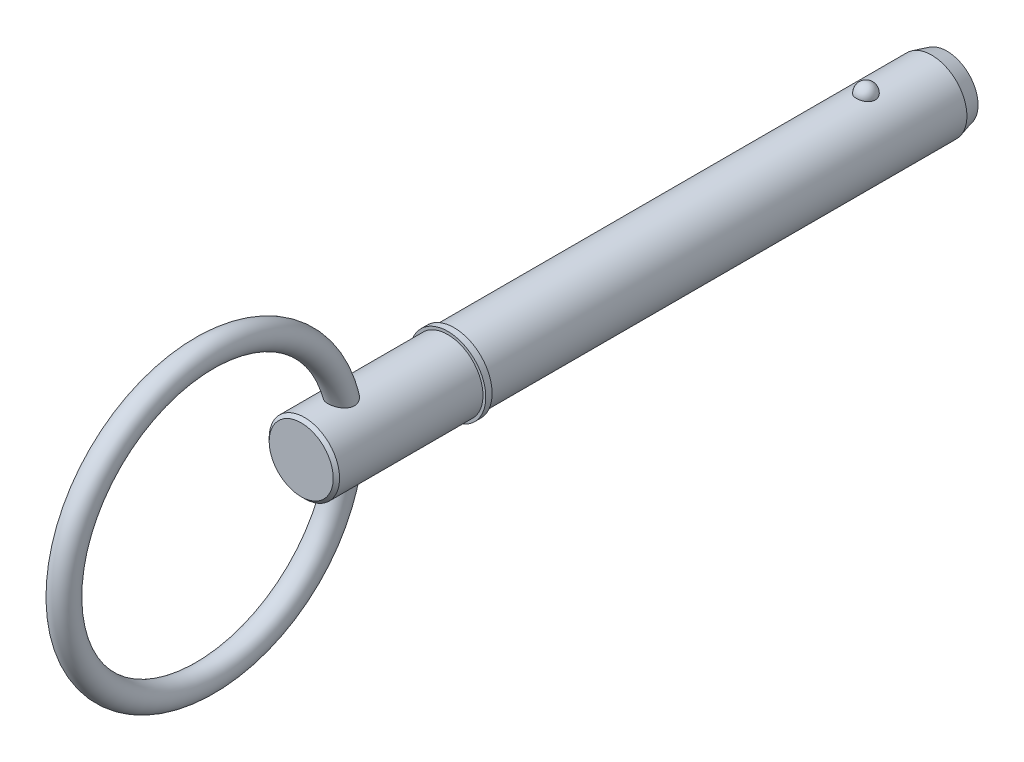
ISO-10303-21;
HEADER;
FILE_DESCRIPTION(('STEP AP214'),'2;1');
FILE_NAME('part.step','',(''),(''),'','','');
FILE_SCHEMA(('AUTOMOTIVE_DESIGN { 1 0 10303 214 1 1 1 1 }'));
ENDSEC;
DATA;
#1=APPLICATION_CONTEXT('core data for automotive mechanical design processes');
#2=APPLICATION_PROTOCOL_DEFINITION('international standard','automotive_design',2000,#1);
#3=PRODUCT_CONTEXT('',#1,'mechanical');
#4=PRODUCT('Part','Part','',(#3));
#5=PRODUCT_RELATED_PRODUCT_CATEGORY('part','',(#4));
#6=PRODUCT_DEFINITION_FORMATION('','',#4);
#7=PRODUCT_DEFINITION_CONTEXT('part definition',#1,'design');
#8=PRODUCT_DEFINITION('design','',#6,#7);
#9=PRODUCT_DEFINITION_SHAPE('','',#8);
#10=(LENGTH_UNIT() NAMED_UNIT(*) SI_UNIT(.MILLI.,.METRE.));
#11=(NAMED_UNIT(*) PLANE_ANGLE_UNIT() SI_UNIT($,.RADIAN.));
#12=(NAMED_UNIT(*) SI_UNIT($,.STERADIAN.) SOLID_ANGLE_UNIT());
#13=UNCERTAINTY_MEASURE_WITH_UNIT(LENGTH_MEASURE(1.E-05),#10,'distance_accuracy_value','');
#14=(GEOMETRIC_REPRESENTATION_CONTEXT(3) GLOBAL_UNCERTAINTY_ASSIGNED_CONTEXT((#13)) GLOBAL_UNIT_ASSIGNED_CONTEXT((#10,
#11,#12)) REPRESENTATION_CONTEXT('',''));
#15=CARTESIAN_POINT('',(0.,0.,0.));
#16=DIRECTION('',(0.,0.,1.));
#17=DIRECTION('',(1.,0.,0.));
#18=AXIS2_PLACEMENT_3D('',#15,#16,#17);
#19=CARTESIAN_POINT('',(0.,0.,63.5));
#20=DIRECTION('',(0.,0.,-1.));
#21=DIRECTION('',(-1.,0.,0.));
#22=AXIS2_PLACEMENT_3D('',#19,#20,#21);
#23=CYLINDRICAL_SURFACE('',#22,5.555);
#24=CARTESIAN_POINT('',(1.47653932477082,5.35517101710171,-1.49));
#25=CARTESIAN_POINT('',(1.4765376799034,5.35517235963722,-1.40667872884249));
#26=CARTESIAN_POINT('',(1.4697233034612,5.35706459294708,-1.32333626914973));
#27=CARTESIAN_POINT('',(1.4426291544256,5.36442332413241,-1.15900769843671));
#28=CARTESIAN_POINT('',(1.42234344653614,5.36989139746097,-1.07802264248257));
#29=CARTESIAN_POINT('',(1.36882802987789,5.38378061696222,-0.920757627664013));
#30=CARTESIAN_POINT('',(1.33560404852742,5.39220045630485,-0.844475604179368));
#31=CARTESIAN_POINT('',(1.25704906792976,5.41105136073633,-0.69870312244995));
#32=CARTESIAN_POINT('',(1.21171855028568,5.42148234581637,-0.62921239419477));
#33=CARTESIAN_POINT('',(1.10986325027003,5.44324765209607,-0.498626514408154));
#34=CARTESIAN_POINT('',(1.05328868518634,5.45458585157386,-0.43757082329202));
#35=CARTESIAN_POINT('',(0.930545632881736,5.4768596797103,-0.325918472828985));
#36=CARTESIAN_POINT('',(0.864377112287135,5.48779530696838,-0.275321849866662));
#37=CARTESIAN_POINT('',(0.724412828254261,5.50801510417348,-0.186125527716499));
#38=CARTESIAN_POINT('',(0.650637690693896,5.51730356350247,-0.147494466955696));
#39=CARTESIAN_POINT('',(0.497383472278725,5.53322345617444,-0.0831582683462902));
#40=CARTESIAN_POINT('',(0.417904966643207,5.53985515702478,-0.0574518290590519));
#41=CARTESIAN_POINT('',(0.256903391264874,5.54963245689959,-0.0200294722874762));
#42=CARTESIAN_POINT('',(0.17543580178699,5.55283384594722,-0.00808940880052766));
#43=CARTESIAN_POINT('',(0.011588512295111,5.55559187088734,0.00221439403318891));
#44=CARTESIAN_POINT('',(-0.0707911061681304,5.55514883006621,0.000579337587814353));
#45=CARTESIAN_POINT('',(-0.232980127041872,5.55069756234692,-0.0161051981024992));
#46=CARTESIAN_POINT('',(-0.312809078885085,5.54673626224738,-0.0309781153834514));
#47=CARTESIAN_POINT('',(-0.468771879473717,5.5357377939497,-0.0734743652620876));
#48=CARTESIAN_POINT('',(-0.544905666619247,5.52870057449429,-0.101097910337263));
#49=CARTESIAN_POINT('',(-0.691800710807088,5.51225307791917,-0.168516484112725));
#50=CARTESIAN_POINT('',(-0.762530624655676,5.50283015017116,-0.208376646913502));
#51=CARTESIAN_POINT('',(-0.896294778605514,5.48263289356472,-0.299136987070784));
#52=CARTESIAN_POINT('',(-0.959328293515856,5.47185843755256,-0.350038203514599));
#53=CARTESIAN_POINT('',(-1.07712789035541,5.44990641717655,-0.462517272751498));
#54=CARTESIAN_POINT('',(-1.13172901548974,5.43872509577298,-0.524267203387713));
#55=CARTESIAN_POINT('',(-1.2299173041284,5.41736658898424,-0.6561336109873));
#56=CARTESIAN_POINT('',(-1.2735037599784,5.40718946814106,-0.726250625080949));
#57=CARTESIAN_POINT('',(-1.34896420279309,5.38886361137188,-0.873713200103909));
#58=CARTESIAN_POINT('',(-1.38071142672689,5.38073711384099,-0.951126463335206));
#59=CARTESIAN_POINT('',(-1.4310375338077,5.36757288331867,-1.11037033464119));
#60=CARTESIAN_POINT('',(-1.44961676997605,5.3625350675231,-1.19220082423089));
#61=CARTESIAN_POINT('',(-1.47308754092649,5.35613553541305,-1.35761209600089));
#62=CARTESIAN_POINT('',(-1.47803294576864,5.35475935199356,-1.44118467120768));
#63=CARTESIAN_POINT('',(-1.47426441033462,5.35579807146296,-1.6079958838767));
#64=CARTESIAN_POINT('',(-1.46555080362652,5.35821288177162,-1.69123452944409));
#65=CARTESIAN_POINT('',(-1.43475662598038,5.36653964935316,-1.8546288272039));
#66=CARTESIAN_POINT('',(-1.41273621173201,5.37243586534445,-1.93479663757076));
#67=CARTESIAN_POINT('',(-1.35593151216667,5.38705199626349,-2.0902011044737));
#68=CARTESIAN_POINT('',(-1.32114675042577,5.39577201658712,-2.16543757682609));
#69=CARTESIAN_POINT('',(-1.23947506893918,5.41511674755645,-2.30926926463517));
#70=CARTESIAN_POINT('',(-1.1925277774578,5.42575087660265,-2.37782893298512));
#71=CARTESIAN_POINT('',(-1.08780725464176,5.44771095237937,-2.50598876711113));
#72=CARTESIAN_POINT('',(-1.03003365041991,5.4590369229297,-2.56558862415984));
#73=CARTESIAN_POINT('',(-0.90495349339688,5.48116073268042,-2.67436535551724));
#74=CARTESIAN_POINT('',(-0.837616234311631,5.49195671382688,-2.7235073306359));
#75=CARTESIAN_POINT('',(-0.69537970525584,5.51177099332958,-2.8097317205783));
#76=CARTESIAN_POINT('',(-0.620480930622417,5.52078940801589,-2.84681492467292));
#77=CARTESIAN_POINT('',(-0.466144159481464,5.53594369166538,-2.90749751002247));
#78=CARTESIAN_POINT('',(-0.386768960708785,5.54211181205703,-2.93124844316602));
#79=CARTESIAN_POINT('',(-0.224991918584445,5.5510324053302,-2.96523308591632));
#80=CARTESIAN_POINT('',(-0.142590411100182,5.55378525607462,-2.97546829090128));
#81=CARTESIAN_POINT('',(0.0213711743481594,5.55555351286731,-2.98206550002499));
#82=CARTESIAN_POINT('',(0.102921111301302,5.55463281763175,-2.97866468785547));
#83=CARTESIAN_POINT('',(0.2642564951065,5.54929804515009,-2.95862186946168));
#84=CARTESIAN_POINT('',(0.344041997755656,5.54488407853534,-2.94198028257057));
#85=CARTESIAN_POINT('',(0.499344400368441,5.53305794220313,-2.89600357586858));
#86=CARTESIAN_POINT('',(0.574874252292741,5.52565550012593,-2.86670961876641));
#87=CARTESIAN_POINT('',(0.71989857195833,5.50863937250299,-2.79624249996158));
#88=CARTESIAN_POINT('',(0.78939269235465,5.49902555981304,-2.75506865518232));
#89=CARTESIAN_POINT('',(0.921480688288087,5.47845199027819,-2.66127110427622));
#90=CARTESIAN_POINT('',(0.983960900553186,5.46747485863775,-2.60849118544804));
#91=CARTESIAN_POINT('',(1.09925057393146,5.44546837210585,-2.49325304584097));
#92=CARTESIAN_POINT('',(1.15205830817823,5.43443900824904,-2.43079310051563));
#93=CARTESIAN_POINT('',(1.24742943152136,5.41335152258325,-2.29680711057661));
#94=CARTESIAN_POINT('',(1.28981661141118,5.40331162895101,-2.22515272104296));
#95=CARTESIAN_POINT('',(1.36214937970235,5.38553336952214,-2.07558035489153));
#96=CARTESIAN_POINT('',(1.39210034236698,5.37779400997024,-1.99766510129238));
#97=CARTESIAN_POINT('',(1.43569518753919,5.36630594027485,-1.84848338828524));
#98=CARTESIAN_POINT('',(1.45098536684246,5.36216169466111,-1.77772322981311));
#99=CARTESIAN_POINT('',(1.47140805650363,5.35659367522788,-1.63464735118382));
#100=CARTESIAN_POINT('',(1.47654075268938,5.35516985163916,-1.56233165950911));
#101=CARTESIAN_POINT('',(1.47653932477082,5.35517101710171,-1.49));
#102=B_SPLINE_CURVE_WITH_KNOTS('',3,(#24,#25,#26,#27,#28,#29,#30,#31,#32,#33,#34,#35,#36,#37,
#38,#39,#40,#41,#42,#43,#44,#45,#46,#47,#48,#49,#50,#51,#52,#53,#54,#55,#56,#57,#58,#59,#60,#61,
#62,#63,#64,#65,#66,#67,#68,#69,#70,#71,#72,#73,#74,#75,#76,#77,#78,#79,#80,#81,#82,#83,#84,#85,
#86,#87,#88,#89,#90,#91,#92,#93,#94,#95,#96,#97,#98,#99,#100,#101),.UNSPECIFIED.,.T.,.F.,(4,2,2,
2,2,2,2,2,2,2,2,2,2,2,2,2,2,2,2,2,2,2,2,2,2,2,2,2,2,2,2,2,2,2,2,2,2,2,4),(0.,0.249703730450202,
0.4995175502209,0.749220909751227,0.998914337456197,1.24973894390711,1.50056442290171,
1.75072681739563,2.00086401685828,2.24686822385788,2.49285060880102,2.73560052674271,
2.97835449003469,3.22242369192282,3.46651587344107,3.71490232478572,3.96330473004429,
4.21429522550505,4.46527899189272,4.71526963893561,4.96525418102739,5.21411697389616,
5.46298905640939,5.71312097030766,5.96326150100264,6.21422412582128,6.46517032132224,
6.71320296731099,6.96120816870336,7.20491846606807,7.44862104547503,7.69153667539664,
7.93446627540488,8.18089104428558,8.42735976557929,8.67774679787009,8.92802551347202,
9.14479867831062,9.36156787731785),.UNSPECIFIED.);
#103=CARTESIAN_POINT('',(1.47653932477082,5.35517101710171,-1.49));
#104=VERTEX_POINT('',#103);
#105=EDGE_CURVE('E103',#104,#104,#102,.T.);
#106=ORIENTED_EDGE('',*,*,#105,.T.);
#107=EDGE_LOOP('',(#106));
#108=FACE_BOUND('',#107,.T.);
#109=CARTESIAN_POINT('',(0.,0.,-11.87));
#110=DIRECTION('',(0.,0.,-1.));
#111=DIRECTION('',(-1.,0.,0.));
#112=AXIS2_PLACEMENT_3D('',#109,#110,#111);
#113=CIRCLE('',#112,5.555);
#114=CARTESIAN_POINT('',(-5.555,0.,-11.87));
#115=VERTEX_POINT('',#114);
#116=EDGE_CURVE('E111',#115,#115,#113,.F.);
#117=ORIENTED_EDGE('',*,*,#116,.T.);
#118=EDGE_LOOP('',(#117));
#119=FACE_BOUND('',#118,.T.);
#120=CARTESIAN_POINT('',(0.,0.,63.5));
#121=DIRECTION('',(0.,0.,1.));
#122=DIRECTION('',(1.,0.,0.));
#123=AXIS2_PLACEMENT_3D('',#120,#121,#122);
#124=CIRCLE('',#123,5.555);
#125=CARTESIAN_POINT('',(5.555,0.,63.5));
#126=VERTEX_POINT('',#125);
#127=EDGE_CURVE('E109',#126,#126,#124,.T.);
#128=ORIENTED_EDGE('',*,*,#127,.F.);
#129=EDGE_LOOP('',(#128));
#130=FACE_BOUND('',#129,.T.);
#131=ADVANCED_FACE('F39',(#108,#119,#130),#23,.T.);
#132=CARTESIAN_POINT('',(0.,0.,-14.27));
#133=DIRECTION('',(0.,0.,-1.));
#134=DIRECTION('',(-1.,0.,0.));
#135=AXIS2_PLACEMENT_3D('',#132,#133,#134);
#136=PLANE('',#135);
#137=CARTESIAN_POINT('',(0.,0.,-14.27));
#138=DIRECTION('',(0.,0.,-1.));
#139=DIRECTION('',(-1.,0.,0.));
#140=AXIS2_PLACEMENT_3D('',#137,#138,#139);
#141=CIRCLE('',#140,4.91192193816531);
#142=CARTESIAN_POINT('',(-4.91192193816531,0.,-14.27));
#143=VERTEX_POINT('',#142);
#144=EDGE_CURVE('E144',#143,#143,#141,.T.);
#145=ORIENTED_EDGE('',*,*,#144,.T.);
#146=EDGE_LOOP('',(#145));
#147=FACE_BOUND('',#146,.T.);
#148=ADVANCED_FACE('F89',(#147),#136,.T.);
#149=CARTESIAN_POINT('',(0.,0.,-14.27));
#150=DIRECTION('',(0.,0.,1.));
#151=DIRECTION('',(1.,0.,0.));
#152=AXIS2_PLACEMENT_3D('',#149,#150,#151);
#153=CONICAL_SURFACE('',#152,4.91192193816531,0.261799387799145);
#154=ORIENTED_EDGE('',*,*,#116,.F.);
#155=EDGE_LOOP('',(#154));
#156=FACE_BOUND('',#155,.T.);
#157=ORIENTED_EDGE('',*,*,#144,.F.);
#158=EDGE_LOOP('',(#157));
#159=FACE_BOUND('',#158,.T.);
#160=ADVANCED_FACE('F95',(#156,#159),#153,.T.);
#161=CARTESIAN_POINT('',(0.,5.555,-1.49));
#162=DIRECTION('',(0.,1.,0.));
#163=DIRECTION('',(0.,0.,1.));
#164=AXIS2_PLACEMENT_3D('',#161,#162,#163);
#165=SPHERICAL_SURFACE('',#164,1.49);
#166=ORIENTED_EDGE('',*,*,#105,.F.);
#167=EDGE_LOOP('',(#166));
#168=FACE_BOUND('',#167,.T.);
#169=ADVANCED_FACE('F114',(#168),#165,.T.);
#170=CARTESIAN_POINT('',(0.,0.,63.5));
#171=DIRECTION('',(0.,0.,-1.));
#172=DIRECTION('',(-1.,0.,0.));
#173=AXIS2_PLACEMENT_3D('',#170,#171,#172);
#174=PLANE('',#173);
#175=ORIENTED_EDGE('',*,*,#127,.T.);
#176=EDGE_LOOP('',(#175));
#177=FACE_BOUND('',#176,.T.);
#178=CARTESIAN_POINT('',(0.,0.,63.5));
#179=DIRECTION('',(0.,0.,-1.));
#180=DIRECTION('',(-1.,0.,0.));
#181=AXIS2_PLACEMENT_3D('',#178,#179,#180);
#182=CIRCLE('',#181,6.);
#183=CARTESIAN_POINT('',(-6.,0.,63.5));
#184=VERTEX_POINT('',#183);
#185=EDGE_CURVE('E110',#184,#184,#182,.T.);
#186=ORIENTED_EDGE('',*,*,#185,.T.);
#187=EDGE_LOOP('',(#186));
#188=FACE_BOUND('',#187,.T.);
#189=ADVANCED_FACE('F118',(#177,#188),#174,.T.);
#190=CARTESIAN_POINT('',(0.,0.,33.7287874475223));
#191=DIRECTION('',(0.,0.,-1.));
#192=DIRECTION('',(-1.,0.,0.));
#193=AXIS2_PLACEMENT_3D('',#190,#191,#192);
#194=CYLINDRICAL_SURFACE('',#193,6.);
#195=CARTESIAN_POINT('',(0.,0.,64.5));
#196=DIRECTION('',(0.,0.,-1.));
#197=DIRECTION('',(-1.,0.,0.));
#198=AXIS2_PLACEMENT_3D('',#195,#196,#197);
#199=CIRCLE('',#198,6.);
#200=CARTESIAN_POINT('',(-6.,0.,64.5));
#201=VERTEX_POINT('',#200);
#202=EDGE_CURVE('E135',#201,#201,#199,.T.);
#203=ORIENTED_EDGE('',*,*,#202,.T.);
#204=EDGE_LOOP('',(#203));
#205=FACE_BOUND('',#204,.T.);
#206=ORIENTED_EDGE('',*,*,#185,.F.);
#207=EDGE_LOOP('',(#206));
#208=FACE_BOUND('',#207,.T.);
#209=ADVANCED_FACE('F122',(#205,#208),#194,.T.);
#210=CARTESIAN_POINT('',(0.,6.,64.5));
#211=DIRECTION('',(0.,0.,1.));
#212=DIRECTION('',(1.,0.,0.));
#213=AXIS2_PLACEMENT_3D('',#210,#211,#212);
#214=PLANE('',#213);
#215=CARTESIAN_POINT('',(0.,0.,64.5));
#216=DIRECTION('',(0.,0.,1.));
#217=DIRECTION('',(1.,0.,0.));
#218=AXIS2_PLACEMENT_3D('',#215,#216,#217);
#219=CIRCLE('',#218,5.555);
#220=CARTESIAN_POINT('',(5.555,0.,64.5));
#221=VERTEX_POINT('',#220);
#222=EDGE_CURVE('E113',#221,#221,#219,.T.);
#223=ORIENTED_EDGE('',*,*,#222,.F.);
#224=EDGE_LOOP('',(#223));
#225=FACE_BOUND('',#224,.T.);
#226=ORIENTED_EDGE('',*,*,#202,.F.);
#227=EDGE_LOOP('',(#226));
#228=FACE_BOUND('',#227,.T.);
#229=ADVANCED_FACE('F86',(#225,#228),#214,.T.);
#230=CARTESIAN_POINT('',(0.,0.,87.63));
#231=DIRECTION('',(0.,0.,-1.));
#232=DIRECTION('',(-1.,0.,0.));
#233=AXIS2_PLACEMENT_3D('',#230,#231,#232);
#234=CYLINDRICAL_SURFACE('',#233,5.555);
#235=CARTESIAN_POINT('',(-0.961380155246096,-5.47117658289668,79.5087332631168));
#236=CARTESIAN_POINT('',(-0.863231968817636,-5.48842171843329,79.4575155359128));
#237=CARTESIAN_POINT('',(-0.7605484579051,-5.50372118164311,79.4143181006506));
#238=CARTESIAN_POINT('',(-0.548956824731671,-5.52883500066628,79.3449127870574));
#239=CARTESIAN_POINT('',(-0.440048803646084,-5.53864944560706,79.3187046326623));
#240=CARTESIAN_POINT('',(-0.219033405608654,-5.55178384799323,79.2838646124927));
#241=CARTESIAN_POINT('',(-0.106925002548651,-5.55510169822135,79.2752384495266));
#242=CARTESIAN_POINT('',(0.11723899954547,-5.55489351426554,79.2757834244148));
#243=CARTESIAN_POINT('',(0.229294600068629,-5.55136768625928,79.2849540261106));
#244=CARTESIAN_POINT('',(0.449588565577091,-5.5378711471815,79.3207847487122));
#245=CARTESIAN_POINT('',(0.557843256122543,-5.52793284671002,79.3473569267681));
#246=CARTESIAN_POINT('',(0.768116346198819,-5.50265785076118,79.4173095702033));
#247=CARTESIAN_POINT('',(0.87013418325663,-5.48732066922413,79.4606915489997));
#248=CARTESIAN_POINT('',(1.06580880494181,-5.45270790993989,79.5636854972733));
#249=CARTESIAN_POINT('',(1.1594033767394,-5.43340601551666,79.6234068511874));
#250=CARTESIAN_POINT('',(1.33484934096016,-5.39298781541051,79.7576727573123));
#251=CARTESIAN_POINT('',(1.41670019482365,-5.37187142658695,79.8322179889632));
#252=CARTESIAN_POINT('',(1.56628651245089,-5.33017932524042,79.9944337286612));
#253=CARTESIAN_POINT('',(1.63402728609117,-5.30960341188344,80.0820992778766));
#254=CARTESIAN_POINT('',(1.7533832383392,-5.27139606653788,80.26835593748));
#255=CARTESIAN_POINT('',(1.80500413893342,-5.25376359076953,80.3669431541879));
#256=CARTESIAN_POINT('',(1.88923054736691,-5.22405733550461,80.5688661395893));
#257=CARTESIAN_POINT('',(1.92240068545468,-5.21182119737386,80.6719426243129));
#258=CARTESIAN_POINT('',(1.97156802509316,-5.19342304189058,80.8826121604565));
#259=CARTESIAN_POINT('',(1.98756752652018,-5.18726021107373,80.9902046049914));
#260=CARTESIAN_POINT('',(2.00238957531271,-5.1815556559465,81.2048133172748));
#261=CARTESIAN_POINT('',(2.0015062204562,-5.18190056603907,81.3118070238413));
#262=CARTESIAN_POINT('',(1.98404322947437,-5.18861029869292,81.5242949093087));
#263=CARTESIAN_POINT('',(1.96745884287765,-5.19497694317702,81.62978862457));
#264=CARTESIAN_POINT('',(1.91810947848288,-5.21340722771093,81.8437346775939));
#265=CARTESIAN_POINT('',(1.88435438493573,-5.22581720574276,81.9519270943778));
#266=CARTESIAN_POINT('',(1.80161540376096,-5.25491400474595,82.1617187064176));
#267=CARTESIAN_POINT('',(1.75262312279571,-5.27160318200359,82.263314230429));
#268=CARTESIAN_POINT('',(1.63431251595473,-5.30955034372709,82.4688565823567));
#269=CARTESIAN_POINT('',(1.56333412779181,-5.33111051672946,82.5717964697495));
#270=CARTESIAN_POINT('',(1.40529607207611,-5.37493145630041,82.7644716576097));
#271=CARTESIAN_POINT('',(1.31822569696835,-5.39719268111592,82.8541980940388));
#272=CARTESIAN_POINT('',(1.12728892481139,-5.44031451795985,83.0190042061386));
#273=CARTESIAN_POINT('',(1.02309899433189,-5.46113424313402,83.093723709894));
#274=CARTESIAN_POINT('',(0.801576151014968,-5.49800171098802,83.2218052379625));
#275=CARTESIAN_POINT('',(0.684264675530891,-5.51405708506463,83.275201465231));
#276=CARTESIAN_POINT('',(0.456877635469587,-5.53719478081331,83.350980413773));
#277=CARTESIAN_POINT('',(0.347974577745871,-5.54519800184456,83.3765844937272));
#278=CARTESIAN_POINT('',(0.127042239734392,-5.55464249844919,83.4067313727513));
#279=CARTESIAN_POINT('',(0.0150164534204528,-5.55609083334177,83.411296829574));
#280=CARTESIAN_POINT('',(-0.191993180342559,-5.55250986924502,83.3999113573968));
#281=CARTESIAN_POINT('',(-0.287160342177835,-5.54836194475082,83.3867524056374));
#282=CARTESIAN_POINT('',(-0.473863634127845,-5.53554271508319,83.3454897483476));
#283=CARTESIAN_POINT('',(-0.565399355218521,-5.52687090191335,83.3173843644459));
#284=CARTESIAN_POINT('',(-0.743786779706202,-5.50572322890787,83.247293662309));
#285=CARTESIAN_POINT('',(-0.830566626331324,-5.49320168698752,83.2051411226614));
#286=CARTESIAN_POINT('',(-0.996720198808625,-5.46549909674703,83.108875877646));
#287=CARTESIAN_POINT('',(-1.07609119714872,-5.45031707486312,83.0547587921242));
#288=CARTESIAN_POINT('',(-1.23672272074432,-5.41628785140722,82.9282113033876));
#289=CARTESIAN_POINT('',(-1.3167603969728,-5.39722327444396,82.8542891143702));
#290=CARTESIAN_POINT('',(-1.46504263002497,-5.3588760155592,82.695462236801));
#291=CARTESIAN_POINT('',(-1.53327828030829,-5.33959318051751,82.6105493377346));
#292=CARTESIAN_POINT('',(-1.66602271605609,-5.29979878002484,82.4186972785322));
#293=CARTESIAN_POINT('',(-1.72857256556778,-5.27951148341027,82.3103478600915));
#294=CARTESIAN_POINT('',(-1.83559571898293,-5.24326402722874,82.0843258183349));
#295=CARTESIAN_POINT('',(-1.88006296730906,-5.22730531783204,81.9666500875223));
#296=CARTESIAN_POINT('',(-1.94988009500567,-5.20167534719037,81.7220877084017));
#297=CARTESIAN_POINT('',(-1.97477410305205,-5.19215470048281,81.5950527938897));
#298=CARTESIAN_POINT('',(-2.00168294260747,-5.18184594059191,81.3382494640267));
#299=CARTESIAN_POINT('',(-2.0037221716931,-5.18104851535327,81.2084841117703));
#300=CARTESIAN_POINT('',(-1.98467753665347,-5.18836681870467,80.964652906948));
#301=CARTESIAN_POINT('',(-1.96600067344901,-5.19555485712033,80.8503700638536));
#302=CARTESIAN_POINT('',(-1.90923541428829,-5.21668050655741,80.627389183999));
#303=CARTESIAN_POINT('',(-1.87115335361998,-5.23061591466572,80.5186893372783));
#304=CARTESIAN_POINT('',(-1.78015350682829,-5.26224244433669,80.3183712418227));
#305=CARTESIAN_POINT('',(-1.72857344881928,-5.27957041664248,80.2260829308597));
#306=CARTESIAN_POINT('',(-1.61106729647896,-5.31660340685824,80.0516847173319));
#307=CARTESIAN_POINT('',(-1.54514024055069,-5.33630858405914,79.9695754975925));
#308=CARTESIAN_POINT('',(-1.39929408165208,-5.37641320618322,79.8158871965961));
#309=CARTESIAN_POINT('',(-1.31912544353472,-5.39681868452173,79.7445467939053));
#310=CARTESIAN_POINT('',(-1.14786008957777,-5.43582099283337,79.6158557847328));
#311=CARTESIAN_POINT('',(-1.05676174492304,-5.4544175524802,79.5585072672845));
#312=CARTESIAN_POINT('',(-0.961380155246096,-5.47117658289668,79.5087332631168));
#313=B_SPLINE_CURVE_WITH_KNOTS('',3,(#235,#236,#237,#238,#239,#240,#241,#242,#243,#244,#245,
#246,#247,#248,#249,#250,#251,#252,#253,#254,#255,#256,#257,#258,#259,#260,#261,#262,#263,#264,
#265,#266,#267,#268,#269,#270,#271,#272,#273,#274,#275,#276,#277,#278,#279,#280,#281,#282,#283,
#284,#285,#286,#287,#288,#289,#290,#291,#292,#293,#294,#295,#296,#297,#298,#299,#300,#301,#302,
#303,#304,#305,#306,#307,#308,#309,#310,#311,#312),.UNSPECIFIED.,.T.,.F.,(4,2,2,2,2,2,2,2,2,2,2,
2,2,2,2,2,2,2,2,2,2,2,2,2,2,2,2,2,2,2,2,2,2,2,2,2,2,2,4),(0.,0.335747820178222,0.67149018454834,
1.0073414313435,1.3431825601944,1.6773394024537,2.01152633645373,2.3480076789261,
2.68450444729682,3.02087435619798,3.35712472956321,3.68242216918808,4.0076760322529,
4.32726924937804,4.6469591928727,4.98762165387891,5.32847210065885,5.7074287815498,
6.08663853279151,6.47407889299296,6.86089527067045,7.19531213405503,7.52936875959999,
7.81649827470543,8.10366003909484,8.39437023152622,8.68518702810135,9.01572837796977,
9.34651809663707,9.72504519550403,10.1036989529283,10.4909301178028,10.8777478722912,
11.2239231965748,11.5699855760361,11.8899109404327,12.2098577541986,12.5360928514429,
12.8623766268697),.UNSPECIFIED.);
#314=CARTESIAN_POINT('',(-0.961380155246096,-5.47117658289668,79.5087332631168));
#315=VERTEX_POINT('',#314);
#316=EDGE_CURVE('E10',#315,#315,#313,.T.);
#317=ORIENTED_EDGE('',*,*,#316,.F.);
#318=EDGE_LOOP('',(#317));
#319=FACE_BOUND('',#318,.T.);
#320=CARTESIAN_POINT('',(-0.961380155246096,5.47117658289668,79.5087332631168));
#321=CARTESIAN_POINT('',(-1.05891474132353,5.45403910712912,79.5596311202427));
#322=CARTESIAN_POINT('',(-1.15197270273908,5.43497920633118,79.6184510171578));
#323=CARTESIAN_POINT('',(-1.32661268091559,5.39501222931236,79.7507016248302));
#324=CARTESIAN_POINT('',(-1.40819495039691,5.37410519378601,79.8241320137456));
#325=CARTESIAN_POINT('',(-1.55769110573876,5.33269731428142,79.984098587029));
#326=CARTESIAN_POINT('',(-1.62558729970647,5.3121970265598,80.0706514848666));
#327=CARTESIAN_POINT('',(-1.74556031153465,5.27399510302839,80.2546466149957));
#328=CARTESIAN_POINT('',(-1.7976419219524,5.25629262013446,80.3520855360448));
#329=CARTESIAN_POINT('',(-1.88339939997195,5.22617061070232,80.5525656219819));
#330=CARTESIAN_POINT('',(-1.91750373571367,5.21362983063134,80.6554052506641));
#331=CARTESIAN_POINT('',(-1.96852412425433,5.194582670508,80.8657781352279));
#332=CARTESIAN_POINT('',(-1.98544249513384,5.18807547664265,80.9733107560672));
#333=CARTESIAN_POINT('',(-2.00201964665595,5.18170011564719,81.1878197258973));
#334=CARTESIAN_POINT('',(-2.00199605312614,5.18170977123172,81.294768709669));
#335=CARTESIAN_POINT('',(-1.98621575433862,5.18777751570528,81.5073062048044));
#336=CARTESIAN_POINT('',(-1.97045441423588,5.19383738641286,81.6128943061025));
#337=CARTESIAN_POINT('',(-1.92280904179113,5.21167084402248,81.8269141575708));
#338=CARTESIAN_POINT('',(-1.88996782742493,5.22378174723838,81.9351030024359));
#339=CARTESIAN_POINT('',(-1.8090690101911,5.252344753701,82.145029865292));
#340=CARTESIAN_POINT('',(-1.76100319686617,5.26879919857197,82.246764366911));
#341=CARTESIAN_POINT('',(-1.64464870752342,5.30634509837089,82.4527880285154));
#342=CARTESIAN_POINT('',(-1.57469702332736,5.32774959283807,82.5560850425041));
#343=CARTESIAN_POINT('',(-1.41872356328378,5.37138743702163,82.7496881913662));
#344=CARTESIAN_POINT('',(-1.3326906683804,5.39362135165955,82.8399852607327));
#345=CARTESIAN_POINT('',(-1.14345202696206,5.43692909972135,83.0065572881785));
#346=CARTESIAN_POINT('',(-1.03986000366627,5.45795811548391,83.0824096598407));
#347=CARTESIAN_POINT('',(-0.819338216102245,5.49537389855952,83.2129167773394));
#348=CARTESIAN_POINT('',(-0.70242947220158,5.51176784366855,83.2676043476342));
#349=CARTESIAN_POINT('',(-0.475167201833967,5.53565843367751,83.3460220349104));
#350=CARTESIAN_POINT('',(-0.365997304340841,5.54404610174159,83.3728937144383));
#351=CARTESIAN_POINT('',(-0.144272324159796,5.55422966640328,83.4054265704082));
#352=CARTESIAN_POINT('',(-0.031721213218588,5.55603301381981,83.4111117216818));
#353=CARTESIAN_POINT('',(0.176166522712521,5.55303883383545,83.4015929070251));
#354=CARTESIAN_POINT('',(0.271662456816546,5.54914868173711,83.3892608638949));
#355=CARTESIAN_POINT('',(0.459140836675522,5.53678955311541,83.3495233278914));
#356=CARTESIAN_POINT('',(0.551122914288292,5.52832009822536,83.322116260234));
#357=CARTESIAN_POINT('',(0.730082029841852,5.50755841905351,83.2534371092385));
#358=CARTESIAN_POINT('',(0.817013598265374,5.49523641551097,83.212056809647));
#359=CARTESIAN_POINT('',(0.98356924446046,5.46788364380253,83.1172936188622));
#360=CARTESIAN_POINT('',(1.06319070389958,5.45285191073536,83.0639064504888));
#361=CARTESIAN_POINT('',(1.22430017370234,5.4191117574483,82.9389828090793));
#362=CARTESIAN_POINT('',(1.30459540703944,5.40018081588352,82.8659703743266));
#363=CARTESIAN_POINT('',(1.45353150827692,5.3620139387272,82.7089433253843));
#364=CARTESIAN_POINT('',(1.52216366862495,5.3427777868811,82.6249205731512));
#365=CARTESIAN_POINT('',(1.65601602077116,5.30294271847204,82.4348114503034));
#366=CARTESIAN_POINT('',(1.71927851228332,5.28255425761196,82.3272944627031));
#367=CARTESIAN_POINT('',(1.82790996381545,5.24595721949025,82.1028474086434));
#368=CARTESIAN_POINT('',(1.8732722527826,5.22975020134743,81.9859138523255));
#369=CARTESIAN_POINT('',(1.94526503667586,5.20341207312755,81.7421941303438));
#370=CARTESIAN_POINT('',(1.97135787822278,5.1934564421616,81.6152273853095));
#371=CARTESIAN_POINT('',(2.00068973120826,5.18223330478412,81.358318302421));
#372=CARTESIAN_POINT('',(2.00395290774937,5.18095661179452,81.2283792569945));
#373=CARTESIAN_POINT('',(1.98717985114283,5.1874070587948,80.983763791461));
#374=CARTESIAN_POINT('',(1.96951989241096,5.19421607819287,80.8688994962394));
#375=CARTESIAN_POINT('',(1.91463360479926,5.2146960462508,80.6445890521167));
#376=CARTESIAN_POINT('',(1.87741409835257,5.22836460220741,80.5351410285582));
#377=CARTESIAN_POINT('',(1.78800305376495,5.25957304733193,80.3335428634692));
#378=CARTESIAN_POINT('',(1.73720600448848,5.27672774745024,80.2407093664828));
#379=CARTESIAN_POINT('',(1.62116201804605,5.3135255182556,80.0651218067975));
#380=CARTESIAN_POINT('',(1.55591428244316,5.33316872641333,79.9823683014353));
#381=CARTESIAN_POINT('',(1.41164041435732,5.37317145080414,79.8276485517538));
#382=CARTESIAN_POINT('',(1.33241957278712,5.39353732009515,79.7558657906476));
#383=CARTESIAN_POINT('',(1.16300716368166,5.43258596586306,79.6261126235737));
#384=CARTESIAN_POINT('',(1.07281393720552,5.45126848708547,79.5681443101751));
#385=CARTESIAN_POINT('',(0.880638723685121,5.48564753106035,79.4655070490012));
#386=CARTESIAN_POINT('',(0.778364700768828,5.50122427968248,79.4213437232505));
#387=CARTESIAN_POINT('',(0.567418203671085,5.52696543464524,79.3499735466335));
#388=CARTESIAN_POINT('',(0.458745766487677,5.53712987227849,79.3227665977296));
#389=CARTESIAN_POINT('',(0.237791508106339,5.55101406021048,79.2858797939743));
#390=CARTESIAN_POINT('',(0.12550171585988,5.55471842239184,79.2762417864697));
#391=CARTESIAN_POINT('',(-0.0992056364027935,5.55525045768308,79.2748490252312));
#392=CARTESIAN_POINT('',(-0.211623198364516,5.55207802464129,79.2830945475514));
#393=CARTESIAN_POINT('',(-0.434217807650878,5.53913427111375,79.317408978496));
#394=CARTESIAN_POINT('',(-0.544370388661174,5.52931142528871,79.3436170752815));
#395=CARTESIAN_POINT('',(-0.75835251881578,5.50404767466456,79.4133955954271));
#396=CARTESIAN_POINT('',(-0.86218167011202,5.48860641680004,79.4569671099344));
#397=CARTESIAN_POINT('',(-0.961380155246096,5.47117658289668,79.5087332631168));
#398=B_SPLINE_CURVE_WITH_KNOTS('',3,(#320,#321,#322,#323,#324,#325,#326,#327,#328,#329,#330,
#331,#332,#333,#334,#335,#336,#337,#338,#339,#340,#341,#342,#343,#344,#345,#346,#347,#348,#349,
#350,#351,#352,#353,#354,#355,#356,#357,#358,#359,#360,#361,#362,#363,#364,#365,#366,#367,#368,
#369,#370,#371,#372,#373,#374,#375,#376,#377,#378,#379,#380,#381,#382,#383,#384,#385,#386,#387,
#388,#389,#390,#391,#392,#393,#394,#395,#396,#397),.UNSPECIFIED.,.T.,.F.,(4,2,2,2,2,2,2,2,2,2,2,
2,2,2,2,2,2,2,2,2,2,2,2,2,2,2,2,2,2,2,2,2,2,2,2,2,2,2,4),(0.,0.333636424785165,
0.667265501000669,1.00132312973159,1.33527942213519,1.66086829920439,1.98641325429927,
2.30585509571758,2.62539104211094,2.96514840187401,3.30508930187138,3.68313901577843,
4.06145109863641,4.4495380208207,4.83702062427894,5.17316628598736,5.508931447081,
5.79666415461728,6.08442692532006,6.37447144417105,6.66461944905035,6.99384361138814,
7.32331250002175,7.70083591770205,8.07849989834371,8.46633986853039,8.85376924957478,
9.20110411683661,9.54831791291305,9.86844524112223,10.1885902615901,10.513611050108,
10.8386810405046,11.1745469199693,11.5104108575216,11.8470737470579,12.183741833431,
12.5230486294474,12.8623767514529),.UNSPECIFIED.);
#399=CARTESIAN_POINT('',(-0.961380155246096,5.47117658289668,79.5087332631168));
#400=VERTEX_POINT('',#399);
#401=EDGE_CURVE('E51',#400,#400,#398,.T.);
#402=ORIENTED_EDGE('',*,*,#401,.F.);
#403=EDGE_LOOP('',(#402));
#404=FACE_BOUND('',#403,.T.);
#405=CARTESIAN_POINT('',(0.,0.,87.1299999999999));
#406=DIRECTION('',(0.,0.,-1.));
#407=DIRECTION('',(-1.,0.,0.));
#408=AXIS2_PLACEMENT_3D('',#405,#406,#407);
#409=CIRCLE('',#408,5.555);
#410=CARTESIAN_POINT('',(-5.555,0.,87.1299999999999));
#411=VERTEX_POINT('',#410);
#412=EDGE_CURVE('E65',#411,#411,#409,.T.);
#413=ORIENTED_EDGE('',*,*,#412,.T.);
#414=EDGE_LOOP('',(#413));
#415=FACE_BOUND('',#414,.T.);
#416=ORIENTED_EDGE('',*,*,#222,.T.);
#417=EDGE_LOOP('',(#416));
#418=FACE_BOUND('',#417,.T.);
#419=ADVANCED_FACE('F70',(#319,#404,#415,#418),#234,.T.);
#420=CARTESIAN_POINT('',(0.,0.,87.63));
#421=DIRECTION('',(0.,0.,-1.));
#422=DIRECTION('',(-1.,0.,0.));
#423=AXIS2_PLACEMENT_3D('',#420,#421,#422);
#424=PLANE('',#423);
#425=CARTESIAN_POINT('',(0.,0.,87.63));
#426=DIRECTION('',(0.,0.,-1.));
#427=DIRECTION('',(-1.,0.,0.));
#428=AXIS2_PLACEMENT_3D('',#425,#426,#427);
#429=CIRCLE('',#428,5.05499999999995);
#430=CARTESIAN_POINT('',(-5.05499999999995,0.,87.63));
#431=VERTEX_POINT('',#430);
#432=EDGE_CURVE('E58',#431,#431,#429,.F.);
#433=ORIENTED_EDGE('',*,*,#432,.T.);
#434=EDGE_LOOP('',(#433));
#435=FACE_BOUND('',#434,.T.);
#436=ADVANCED_FACE('F77',(#435),#424,.F.);
#437=CARTESIAN_POINT('',(0.,0.,87.1299999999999));
#438=DIRECTION('',(0.,0.,-1.));
#439=DIRECTION('',(-1.,0.,0.));
#440=AXIS2_PLACEMENT_3D('',#437,#438,#439);
#441=CONICAL_SURFACE('',#440,5.555,0.785398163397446);
#442=ORIENTED_EDGE('',*,*,#432,.F.);
#443=EDGE_LOOP('',(#442));
#444=FACE_BOUND('',#443,.T.);
#445=ORIENTED_EDGE('',*,*,#412,.F.);
#446=EDGE_LOOP('',(#445));
#447=FACE_BOUND('',#446,.T.);
#448=ADVANCED_FACE('F41',(#444,#447),#441,.T.);
#449=CARTESIAN_POINT('',(0.,0.,102.855));
#450=DIRECTION('',(1.,0.,0.));
#451=DIRECTION('',(0.,0.,-1.));
#452=AXIS2_PLACEMENT_3D('',#449,#450,#451);
#453=TOROIDAL_SURFACE('',#452,22.225,2.);
#454=ORIENTED_EDGE('',*,*,#316,.T.);
#455=EDGE_LOOP('',(#454));
#456=FACE_BOUND('',#455,.T.);
#457=ORIENTED_EDGE('',*,*,#401,.T.);
#458=EDGE_LOOP('',(#457));
#459=FACE_BOUND('',#458,.T.);
#460=ADVANCED_FACE('F74',(#456,#459),#453,.T.);
#461=CLOSED_SHELL('',(#131,#148,#160,#169,#189,#209,#229,#419,#436,#448,#460));
#462=MANIFOLD_SOLID_BREP('B2',#461);
#463=ADVANCED_BREP_SHAPE_REPRESENTATION('',(#18,#462),#14);
#464=SHAPE_DEFINITION_REPRESENTATION(#9,#463);
ENDSEC;
END-ISO-10303-21;
